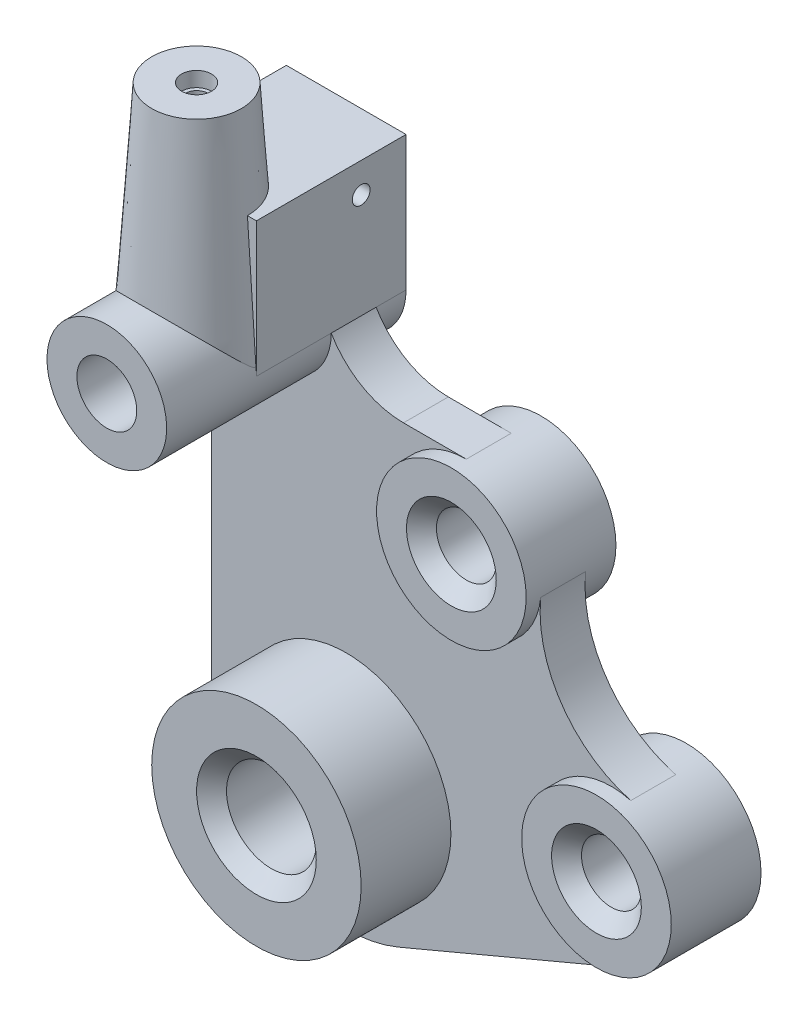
ISO-10303-21;
HEADER;
FILE_DESCRIPTION(('STEP AP214'),'2;1');
FILE_NAME('part.step','',(''),(''),'','','');
FILE_SCHEMA(('AUTOMOTIVE_DESIGN { 1 0 10303 214 1 1 1 1 }'));
ENDSEC;
DATA;
#1=APPLICATION_CONTEXT('core data for automotive mechanical design processes');
#2=APPLICATION_PROTOCOL_DEFINITION('international standard','automotive_design',2000,#1);
#3=PRODUCT_CONTEXT('',#1,'mechanical');
#4=PRODUCT('Part','Part','',(#3));
#5=PRODUCT_RELATED_PRODUCT_CATEGORY('part','',(#4));
#6=PRODUCT_DEFINITION_FORMATION('','',#4);
#7=PRODUCT_DEFINITION_CONTEXT('part definition',#1,'design');
#8=PRODUCT_DEFINITION('design','',#6,#7);
#9=PRODUCT_DEFINITION_SHAPE('','',#8);
#10=(LENGTH_UNIT() NAMED_UNIT(*) SI_UNIT(.MILLI.,.METRE.));
#11=(NAMED_UNIT(*) PLANE_ANGLE_UNIT() SI_UNIT($,.RADIAN.));
#12=(NAMED_UNIT(*) SI_UNIT($,.STERADIAN.) SOLID_ANGLE_UNIT());
#13=UNCERTAINTY_MEASURE_WITH_UNIT(LENGTH_MEASURE(1.E-05),#10,'distance_accuracy_value','');
#14=(GEOMETRIC_REPRESENTATION_CONTEXT(3) GLOBAL_UNCERTAINTY_ASSIGNED_CONTEXT((#13)) GLOBAL_UNIT_ASSIGNED_CONTEXT((#10,
#11,#12)) REPRESENTATION_CONTEXT('',''));
#15=CARTESIAN_POINT('',(0.,0.,0.));
#16=DIRECTION('',(0.,0.,1.));
#17=DIRECTION('',(1.,0.,0.));
#18=AXIS2_PLACEMENT_3D('',#15,#16,#17);
#19=CARTESIAN_POINT('',(-5.,25.,16.));
#20=DIRECTION('',(0.,0.,-1.));
#21=DIRECTION('',(-1.,0.,0.));
#22=AXIS2_PLACEMENT_3D('',#19,#20,#21);
#23=CYLINDRICAL_SURFACE('',#22,1.);
#24=CARTESIAN_POINT('',(-5.,25.,0.));
#25=DIRECTION('',(0.,0.,-1.));
#26=DIRECTION('',(-1.,0.,0.));
#27=AXIS2_PLACEMENT_3D('',#24,#25,#26);
#28=CIRCLE('',#27,1.);
#29=CARTESIAN_POINT('',(-6.,25.,0.));
#30=VERTEX_POINT('',#29);
#31=EDGE_CURVE('E212',#30,#30,#28,.T.);
#32=ORIENTED_EDGE('',*,*,#31,.T.);
#33=EDGE_LOOP('',(#32));
#34=FACE_BOUND('',#33,.T.);
#35=CARTESIAN_POINT('',(-5.,25.,9.));
#36=DIRECTION('',(0.,0.,1.));
#37=DIRECTION('',(1.,0.,0.));
#38=AXIS2_PLACEMENT_3D('',#35,#36,#37);
#39=CIRCLE('',#38,1.);
#40=CARTESIAN_POINT('',(-4.,25.,9.));
#41=VERTEX_POINT('',#40);
#42=EDGE_CURVE('E174',#41,#41,#39,.F.);
#43=ORIENTED_EDGE('',*,*,#42,.F.);
#44=EDGE_LOOP('',(#43));
#45=FACE_BOUND('',#44,.T.);
#46=ADVANCED_FACE('F33',(#34,#45),#23,.F.);
#47=CARTESIAN_POINT('',(-5.,25.,16.));
#48=DIRECTION('',(0.,0.,-1.));
#49=DIRECTION('',(-1.,0.,0.));
#50=AXIS2_PLACEMENT_3D('',#47,#48,#49);
#51=CYLINDRICAL_SURFACE('',#50,4.);
#52=DIRECTION('',(0.,0.,-1.));
#53=VECTOR('',#52,1.);
#54=CARTESIAN_POINT('',(-9.,25.,10.));
#55=LINE('',#54,#53);
#56=CARTESIAN_POINT('',(-9.,25.,2.));
#57=VERTEX_POINT('',#56);
#58=CARTESIAN_POINT('',(-9.,25.,0.));
#59=VERTEX_POINT('',#58);
#60=EDGE_CURVE('E204',#57,#59,#55,.T.);
#61=ORIENTED_EDGE('',*,*,#60,.T.);
#62=CARTESIAN_POINT('',(-5.,25.,0.));
#63=DIRECTION('',(0.,0.,-1.));
#64=DIRECTION('',(-1.,0.,0.));
#65=AXIS2_PLACEMENT_3D('',#62,#63,#64);
#66=CIRCLE('',#65,4.);
#67=CARTESIAN_POINT('',(-0.999999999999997,25.,0.));
#68=VERTEX_POINT('',#67);
#69=EDGE_CURVE('E258',#68,#59,#66,.T.);
#70=ORIENTED_EDGE('',*,*,#69,.F.);
#71=DIRECTION('',(0.,0.,-1.));
#72=VECTOR('',#71,1.);
#73=CARTESIAN_POINT('',(-0.999999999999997,25.,10.));
#74=LINE('',#73,#72);
#75=CARTESIAN_POINT('',(-0.999999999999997,25.,2.));
#76=VERTEX_POINT('',#75);
#77=EDGE_CURVE('E189',#76,#68,#74,.T.);
#78=ORIENTED_EDGE('',*,*,#77,.F.);
#79=CARTESIAN_POINT('',(-5.,25.,2.));
#80=DIRECTION('',(0.,0.,1.));
#81=DIRECTION('',(1.,0.,0.));
#82=AXIS2_PLACEMENT_3D('',#79,#80,#81);
#83=CIRCLE('',#82,4.);
#84=EDGE_CURVE('E267',#57,#76,#83,.T.);
#85=ORIENTED_EDGE('',*,*,#84,.F.);
#86=EDGE_LOOP('',(#61,#70,#78,#85));
#87=FACE_BOUND('',#86,.T.);
#88=ADVANCED_FACE('F233',(#87),#51,.T.);
#89=CARTESIAN_POINT('',(-5.,40.,10.));
#90=DIRECTION('',(0.,-1.,0.));
#91=DIRECTION('',(1.,0.,0.));
#92=AXIS2_PLACEMENT_3D('',#89,#90,#91);
#93=CONICAL_SURFACE('',#92,3.,0.0665681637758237);
#94=CARTESIAN_POINT('',(-5.,40.,10.));
#95=DIRECTION('',(0.,1.,0.));
#96=DIRECTION('',(-1.,0.,0.));
#97=AXIS2_PLACEMENT_3D('',#94,#95,#96);
#98=CIRCLE('',#97,3.);
#99=CARTESIAN_POINT('',(-8.,40.,10.));
#100=VERTEX_POINT('',#99);
#101=EDGE_CURVE('E209',#100,#100,#98,.T.);
#102=ORIENTED_EDGE('',*,*,#101,.F.);
#103=EDGE_LOOP('',(#102));
#104=FACE_BOUND('',#103,.T.);
#105=CARTESIAN_POINT('',(-7.68582917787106,27.9641730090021,7.30844289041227));
#106=CARTESIAN_POINT('',(-7.87145436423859,27.7959706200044,7.47783702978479));
#107=CARTESIAN_POINT('',(-8.035246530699,27.6158841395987,7.65934261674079));
#108=CARTESIAN_POINT('',(-8.24998615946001,27.3348453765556,7.94315535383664));
#109=CARTESIAN_POINT('',(-8.31642185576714,27.2393200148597,8.0397132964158));
#110=CARTESIAN_POINT('',(-8.43944384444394,27.0453361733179,8.23609940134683));
#111=CARTESIAN_POINT('',(-8.49603313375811,26.9468785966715,8.33592655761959));
#112=CARTESIAN_POINT('',(-8.59844682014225,26.7501960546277,8.53588493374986));
#113=CARTESIAN_POINT('',(-8.64449597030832,26.6520216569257,8.6359519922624));
#114=CARTESIAN_POINT('',(-8.7277325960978,26.4544628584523,8.83827041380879));
#115=CARTESIAN_POINT('',(-8.76493210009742,26.3550802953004,8.94051860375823));
#116=CARTESIAN_POINT('',(-8.81898682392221,26.1915948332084,9.11062343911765));
#117=CARTESIAN_POINT('',(-8.83836727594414,26.1275439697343,9.17774736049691));
#118=CARTESIAN_POINT('',(-8.87359959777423,25.9997940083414,9.31343849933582));
#119=CARTESIAN_POINT('',(-8.88944767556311,25.9360953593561,9.38200718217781));
#120=CARTESIAN_POINT('',(-8.91408514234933,25.8260334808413,9.50471878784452));
#121=CARTESIAN_POINT('',(-8.92365412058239,25.7792160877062,9.5583224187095));
#122=CARTESIAN_POINT('',(-8.94058969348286,25.6883224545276,9.66845927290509));
#123=CARTESIAN_POINT('',(-8.94795780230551,25.6442443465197,9.72499045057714));
#124=CARTESIAN_POINT('',(-8.95581978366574,25.5930331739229,9.8070876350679));
#125=CARTESIAN_POINT('',(-8.95767477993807,25.5804643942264,9.82898958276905));
#126=CARTESIAN_POINT('',(-8.9608422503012,25.5584333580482,9.87431424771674));
#127=CARTESIAN_POINT('',(-8.96215765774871,25.5489543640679,9.89772791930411));
#128=CARTESIAN_POINT('',(-8.96368162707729,25.5378187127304,9.93742626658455));
#129=CARTESIAN_POINT('',(-8.96411828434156,25.5345738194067,9.95323635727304));
#130=CARTESIAN_POINT('',(-8.96460979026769,25.5309172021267,9.98517616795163));
#131=CARTESIAN_POINT('',(-8.96466542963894,25.5304996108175,10.0013051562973));
#132=CARTESIAN_POINT('',(-8.96438751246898,25.5325711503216,10.0333365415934));
#133=CARTESIAN_POINT('',(-8.96405448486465,25.5350563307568,10.0492392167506));
#134=CARTESIAN_POINT('',(-8.96305127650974,25.5424381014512,10.0804790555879));
#135=CARTESIAN_POINT('',(-8.96238015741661,25.547341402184,10.0958145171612));
#136=CARTESIAN_POINT('',(-8.95951482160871,25.5678471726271,10.1494331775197));
#137=CARTESIAN_POINT('',(-8.95658729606,25.5881313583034,10.1857842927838));
#138=CARTESIAN_POINT('',(-8.94969115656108,25.6328361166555,10.2558278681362));
#139=CARTESIAN_POINT('',(-8.94571249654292,25.6572957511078,10.2894903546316));
#140=CARTESIAN_POINT('',(-8.93146814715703,25.7394824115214,10.396472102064));
#141=CARTESIAN_POINT('',(-8.91954789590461,25.8006702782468,10.4669160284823));
#142=CARTESIAN_POINT('',(-8.89214832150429,25.9248448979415,10.6055042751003));
#143=CARTESIAN_POINT('',(-8.87666231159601,25.9878348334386,10.6736439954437));
#144=CARTESIAN_POINT('',(-8.84222339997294,26.1142602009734,10.8083167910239));
#145=CARTESIAN_POINT('',(-8.82327989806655,26.1776939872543,10.8748536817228));
#146=CARTESIAN_POINT('',(-8.78191536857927,26.3044431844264,11.0068408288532));
#147=CARTESIAN_POINT('',(-8.75949660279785,26.3677586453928,11.0722917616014));
#148=CARTESIAN_POINT('',(-8.6862782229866,26.5588854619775,11.2690386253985));
#149=CARTESIAN_POINT('',(-8.6299834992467,26.6861300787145,11.3988999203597));
#150=CARTESIAN_POINT('',(-8.50233856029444,26.9374016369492,11.6544976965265));
#151=CARTESIAN_POINT('',(-8.43097643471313,27.061425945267,11.7802308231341));
#152=CARTESIAN_POINT('',(-8.27257126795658,27.3046304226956,12.0263481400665));
#153=CARTESIAN_POINT('',(-8.18553529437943,27.4238127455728,12.1467347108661));
#154=CARTESIAN_POINT('',(-7.99510064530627,27.6555316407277,12.3805644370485));
#155=CARTESIAN_POINT('',(-7.89171641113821,27.7680739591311,12.4940135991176));
#156=CARTESIAN_POINT('',(-7.64749644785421,28.0040930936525,12.7317895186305));
#157=CARTESIAN_POINT('',(-7.50326898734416,28.1258713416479,12.8543778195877));
#158=CARTESIAN_POINT('',(-7.1903321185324,28.3525627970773,13.0824827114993));
#159=CARTESIAN_POINT('',(-7.0216674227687,28.45750608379,13.1880297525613));
#160=CARTESIAN_POINT('',(-6.6930449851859,28.6278518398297,13.3593136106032));
#161=CARTESIAN_POINT('',(-6.53702387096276,28.6969727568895,13.4287978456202));
#162=CARTESIAN_POINT('',(-6.2925871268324,28.7863934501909,13.5186772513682));
#163=CARTESIAN_POINT('',(-6.20934434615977,28.8138303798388,13.5462527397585));
#164=CARTESIAN_POINT('',(-6.0398068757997,28.863494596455,13.5961651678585));
#165=CARTESIAN_POINT('',(-5.9535135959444,28.8857242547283,13.6185044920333));
#166=CARTESIAN_POINT('',(-5.77768444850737,28.924714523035,13.6576856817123));
#167=CARTESIAN_POINT('',(-5.68812764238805,28.9414283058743,13.6744804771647));
#168=CARTESIAN_POINT('',(-5.50720161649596,28.968766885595,13.7019509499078));
#169=CARTESIAN_POINT('',(-5.4158333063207,28.9793946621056,13.7126296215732));
#170=CARTESIAN_POINT('',(-5.23208545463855,28.9943247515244,13.7276310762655));
#171=CARTESIAN_POINT('',(-5.13970619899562,28.9986288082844,13.7319556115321));
#172=CARTESIAN_POINT('',(-4.95480169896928,29.0008129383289,13.7341501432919));
#173=CARTESIAN_POINT('',(-4.86227647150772,28.9986937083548,13.7320208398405));
#174=CARTESIAN_POINT('',(-4.68959143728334,28.9887534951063,13.72203320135));
#175=CARTESIAN_POINT('',(-4.60934296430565,28.9816848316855,13.71493078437));
#176=CARTESIAN_POINT('',(-4.44996289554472,28.9628160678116,13.6959714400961));
#177=CARTESIAN_POINT('',(-4.37083166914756,28.9510144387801,13.6841129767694));
#178=CARTESIAN_POINT('',(-4.1359618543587,28.9087935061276,13.6416872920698));
#179=CARTESIAN_POINT('',(-3.98259980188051,28.87154918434,13.604260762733));
#180=CARTESIAN_POINT('',(-3.68165060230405,28.7798752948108,13.5121269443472));
#181=CARTESIAN_POINT('',(-3.53434669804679,28.7249923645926,13.4569637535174));
#182=CARTESIAN_POINT('',(-3.25217140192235,28.6012299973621,13.3325462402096));
#183=CARTESIAN_POINT('',(-3.11730521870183,28.5323447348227,13.2632860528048));
#184=CARTESIAN_POINT('',(-2.79321185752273,28.3438647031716,13.0737311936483));
#185=CARTESIAN_POINT('',(-2.61285212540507,28.2166923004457,12.9457918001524));
#186=CARTESIAN_POINT('',(-2.28313085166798,27.9435845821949,12.6708541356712));
#187=CARTESIAN_POINT('',(-2.13386439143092,27.7975938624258,12.5237995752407));
#188=CARTESIAN_POINT('',(-1.90655552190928,27.5397572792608,12.2637659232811));
#189=CARTESIAN_POINT('',(-1.82071746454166,27.4311936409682,12.154190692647));
#190=CARTESIAN_POINT('',(-1.66272245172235,27.2093283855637,11.9299570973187));
#191=CARTESIAN_POINT('',(-1.59057233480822,27.0960244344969,11.8152962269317));
#192=CARTESIAN_POINT('',(-1.45956259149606,26.8662193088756,11.5821671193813));
#193=CARTESIAN_POINT('',(-1.40068096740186,26.749723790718,11.4637055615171));
#194=CARTESIAN_POINT('',(-1.29559154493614,26.5145624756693,11.2234895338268));
#195=CARTESIAN_POINT('',(-1.24937700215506,26.3958978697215,11.1017368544));
#196=CARTESIAN_POINT('',(-1.18723891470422,26.211468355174,10.9101391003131));
#197=CARTESIAN_POINT('',(-1.16702584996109,26.1458467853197,10.8415034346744));
#198=CARTESIAN_POINT('',(-1.13030223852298,26.0149043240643,10.7027746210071));
#199=CARTESIAN_POINT('',(-1.11379531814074,25.9495837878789,10.6326801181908));
#200=CARTESIAN_POINT('',(-1.08791721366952,25.8356092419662,10.506158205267));
#201=CARTESIAN_POINT('',(-1.07777676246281,25.7865363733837,10.4502382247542));
#202=CARTESIAN_POINT('',(-1.05990149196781,25.69126516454,10.3354340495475));
#203=CARTESIAN_POINT('',(-1.0521606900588,25.6450599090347,10.2765576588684));
#204=CARTESIAN_POINT('',(-1.04427829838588,25.5936572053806,10.1938421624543));
#205=CARTESIAN_POINT('',(-1.04259787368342,25.5823041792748,10.1741443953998));
#206=CARTESIAN_POINT('',(-1.0396638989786,25.561995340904,10.1335158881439));
#207=CARTESIAN_POINT('',(-1.03840918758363,25.5530330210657,10.1125886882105));
#208=CARTESIAN_POINT('',(-1.03676737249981,25.5411225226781,10.0756549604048));
#209=CARTESIAN_POINT('',(-1.03623406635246,25.5371832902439,10.0599875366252));
#210=CARTESIAN_POINT('',(-1.03553602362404,25.5320082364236,10.0282184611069));
#211=CARTESIAN_POINT('',(-1.0353703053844,25.530765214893,10.0121180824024));
#212=CARTESIAN_POINT('',(-1.03543409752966,25.5312409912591,9.97992802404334));
#213=CARTESIAN_POINT('',(-1.03566451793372,25.5329666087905,9.96383845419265));
#214=CARTESIAN_POINT('',(-1.0364838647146,25.5390262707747,9.93215634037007));
#215=CARTESIAN_POINT('',(-1.03707369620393,25.5433669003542,9.91656515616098));
#216=CARTESIAN_POINT('',(-1.03944186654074,25.5604572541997,9.86718928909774));
#217=CARTESIAN_POINT('',(-1.04178723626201,25.5769618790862,9.83480223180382));
#218=CARTESIAN_POINT('',(-1.04735472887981,25.6139728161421,9.77238923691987));
#219=CARTESIAN_POINT('',(-1.05058515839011,25.6345164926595,9.74238933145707));
#220=CARTESIAN_POINT('',(-1.06195631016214,25.7028787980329,9.64879780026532));
#221=CARTESIAN_POINT('',(-1.07135894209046,25.7540103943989,9.58780636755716));
#222=CARTESIAN_POINT('',(-1.09280352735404,25.8583327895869,9.46806904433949));
#223=CARTESIAN_POINT('',(-1.10485114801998,25.9115278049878,9.40932829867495));
#224=CARTESIAN_POINT('',(-1.13148029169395,26.01861482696,9.29329387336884));
#225=CARTESIAN_POINT('',(-1.1460557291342,26.0725048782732,9.23599708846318));
#226=CARTESIAN_POINT('',(-1.17772230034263,26.1804079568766,9.1223368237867));
#227=CARTESIAN_POINT('',(-1.19481127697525,26.2344208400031,9.06597258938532));
#228=CARTESIAN_POINT('',(-1.25009262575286,26.396896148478,8.89733666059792));
#229=CARTESIAN_POINT('',(-1.2921543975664,26.5052028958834,8.78614984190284));
#230=CARTESIAN_POINT('',(-1.38681808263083,26.7200964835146,8.56649859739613));
#231=CARTESIAN_POINT('',(-1.43942654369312,26.8266822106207,8.45803591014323));
#232=CARTESIAN_POINT('',(-1.55555963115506,27.0372253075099,8.24429301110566));
#233=CARTESIAN_POINT('',(-1.61908938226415,27.1411814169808,8.13901432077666));
#234=CARTESIAN_POINT('',(-1.75742667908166,27.3454053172,7.93247040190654));
#235=CARTESIAN_POINT('',(-1.83222989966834,27.4456745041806,7.83120365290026));
#236=CARTESIAN_POINT('',(-2.03864267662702,27.6961951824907,7.57840275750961));
#237=CARTESIAN_POINT('',(-2.17867516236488,27.8431538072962,7.43031250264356));
#238=CARTESIAN_POINT('',(-2.48883703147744,28.1204503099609,7.15106579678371));
#239=CARTESIAN_POINT('',(-2.65892205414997,28.2508122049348,7.01988487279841));
#240=CARTESIAN_POINT('',(-2.98939297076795,28.4622439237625,6.80720462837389));
#241=CARTESIAN_POINT('',(-3.14386712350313,28.54787068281,6.72110240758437));
#242=CARTESIAN_POINT('',(-3.47048863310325,28.7003989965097,6.56775571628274));
#243=CARTESIAN_POINT('',(-3.64261412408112,28.7673233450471,6.50048829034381));
#244=CARTESIAN_POINT('',(-3.97391965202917,28.8694240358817,6.39787480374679));
#245=CARTESIAN_POINT('',(-4.13105028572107,28.9078914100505,6.3592192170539));
#246=CARTESIAN_POINT('',(-4.4522654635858,28.9656723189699,6.30115802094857));
#247=CARTESIAN_POINT('',(-4.61634604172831,28.9849966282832,6.28174158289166));
#248=CARTESIAN_POINT('',(-4.94721383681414,29.0030895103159,6.26356239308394));
#249=CARTESIAN_POINT('',(-5.11400679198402,29.0018066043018,6.26485136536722));
#250=CARTESIAN_POINT('',(-5.4446841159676,28.9786610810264,6.28810742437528));
#251=CARTESIAN_POINT('',(-5.60856797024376,28.956794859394,6.31007813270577));
#252=CARTESIAN_POINT('',(-5.9232086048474,28.8951915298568,6.37198127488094));
#253=CARTESIAN_POINT('',(-6.07422345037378,28.8560996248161,6.41126523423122));
#254=CARTESIAN_POINT('',(-6.36627844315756,28.762558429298,6.50527833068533));
#255=CARTESIAN_POINT('',(-6.50731450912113,28.7081029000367,6.56001374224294));
#256=CARTESIAN_POINT('',(-6.84318506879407,28.5568315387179,6.71208985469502));
#257=CARTESIAN_POINT('',(-7.03102173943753,28.4522695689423,6.81722970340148));
#258=CARTESIAN_POINT('',(-7.37910283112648,28.2223691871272,7.04850657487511));
#259=CARTESIAN_POINT('',(-7.53927103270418,28.0969751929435,7.17469977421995));
#260=CARTESIAN_POINT('',(-7.68582917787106,27.9641730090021,7.30844289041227));
#261=B_SPLINE_CURVE_WITH_KNOTS('',3,(#105,#106,#107,#108,#109,#110,#111,#112,#113,#114,#115,
#116,#117,#118,#119,#120,#121,#122,#123,#124,#125,#126,#127,#128,#129,#130,#131,#132,#133,#134,
#135,#136,#137,#138,#139,#140,#141,#142,#143,#144,#145,#146,#147,#148,#149,#150,#151,#152,#153,
#154,#155,#156,#157,#158,#159,#160,#161,#162,#163,#164,#165,#166,#167,#168,#169,#170,#171,#172,
#173,#174,#175,#176,#177,#178,#179,#180,#181,#182,#183,#184,#185,#186,#187,#188,#189,#190,#191,
#192,#193,#194,#195,#196,#197,#198,#199,#200,#201,#202,#203,#204,#205,#206,#207,#208,#209,#210,
#211,#212,#213,#214,#215,#216,#217,#218,#219,#220,#221,#222,#223,#224,#225,#226,#227,#228,#229,
#230,#231,#232,#233,#234,#235,#236,#237,#238,#239,#240,#241,#242,#243,#244,#245,#246,#247,#248,
#249,#250,#251,#252,#253,#254,#255,#256,#257,#258,#259,#260),.UNSPECIFIED.,.T.,.F.,(4,2,2,2,2,2,
2,2,2,2,2,2,2,2,2,2,2,2,2,2,2,2,2,2,2,2,2,2,2,2,2,2,2,2,2,2,2,2,2,2,2,2,2,2,2,2,2,2,2,2,2,2,2,2,
2,2,2,2,2,2,2,2,2,2,2,2,2,2,2,2,2,2,2,2,2,2,2,4),(0.,0.906183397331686,1.35952296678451,
1.81272431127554,2.2551055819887,2.696882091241,2.98118412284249,3.26578989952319,
3.48129917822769,3.69665984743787,3.77250844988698,3.84793907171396,3.89616349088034,
3.94428780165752,3.99234669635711,4.04053971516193,4.16469985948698,4.29009250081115,
4.57179840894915,4.85403695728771,5.13551932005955,5.41681924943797,5.98711445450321,
6.55786216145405,7.12835315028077,7.69834297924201,8.3713231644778,9.04308720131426,
9.5934293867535,9.86878537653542,10.1440157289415,10.4215259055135,10.6989001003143,
10.9761977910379,11.2534654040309,11.4957860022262,11.7381849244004,12.2225446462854,
12.7205105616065,13.218684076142,13.9797319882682,14.74307404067,15.2719983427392,
15.8011862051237,16.3294901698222,16.8575122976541,17.1487243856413,17.440220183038,
17.6655792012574,17.8903717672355,17.9586769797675,18.0267943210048,18.0750999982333,
18.1232765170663,18.1715638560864,18.2199733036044,18.3283739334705,18.4378290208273,
18.6777999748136,18.9182902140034,19.1582093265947,19.3979237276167,19.8799739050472,
20.3623242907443,20.844901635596,21.327294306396,22.078571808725,22.8287494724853,
23.416052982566,24.0026375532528,24.4994632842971,24.9960092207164,25.4937957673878,
25.9916694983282,26.4722990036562,26.9531239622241,27.6666549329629,28.3821211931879),.UNSPECIFIED.);
#262=CARTESIAN_POINT('',(-8.96460176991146,25.5309734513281,9.99999999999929));
#263=VERTEX_POINT('',#262);
#264=CARTESIAN_POINT('',(-1.0353982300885,25.5309734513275,10.));
#265=VERTEX_POINT('',#264);
#266=EDGE_CURVE('E213',#263,#265,#261,.T.);
#267=ORIENTED_EDGE('',*,*,#266,.T.);
#268=DIRECTION('',(0.0665190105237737,-0.997785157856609,0.));
#269=VECTOR('',#268,1.);
#270=CARTESIAN_POINT('',(-4.99999999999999,85.0000000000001,10.));
#271=LINE('',#270,#269);
#272=CARTESIAN_POINT('',(-1.6,34.,10.));
#273=VERTEX_POINT('',#272);
#274=EDGE_CURVE('E375',#265,#273,#271,.F.);
#275=ORIENTED_EDGE('',*,*,#274,.T.);
#276=CARTESIAN_POINT('',(-5.,34.,10.));
#277=DIRECTION('',(0.,1.,0.));
#278=DIRECTION('',(0.,0.,1.));
#279=AXIS2_PLACEMENT_3D('',#276,#277,#278);
#280=CIRCLE('',#279,3.4);
#281=CARTESIAN_POINT('',(-8.4,34.,10.));
#282=VERTEX_POINT('',#281);
#283=EDGE_CURVE('E373',#282,#273,#280,.F.);
#284=ORIENTED_EDGE('',*,*,#283,.F.);
#285=DIRECTION('',(0.0665190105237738,0.997785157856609,0.));
#286=VECTOR('',#285,1.);
#287=CARTESIAN_POINT('',(-4.99999999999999,85.0000000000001,10.));
#288=LINE('',#287,#286);
#289=EDGE_CURVE('E220',#282,#263,#288,.F.);
#290=ORIENTED_EDGE('',*,*,#289,.T.);
#291=EDGE_LOOP('',(#267,#275,#284,#290));
#292=FACE_BOUND('',#291,.T.);
#293=ADVANCED_FACE('F227',(#104,#292),#93,.T.);
#294=CARTESIAN_POINT('',(0.,0.,5.));
#295=DIRECTION('',(0.,0.,1.));
#296=DIRECTION('',(1.,0.,0.));
#297=AXIS2_PLACEMENT_3D('',#294,#295,#296);
#298=PLANE('',#297);
#299=CARTESIAN_POINT('',(-5.,25.,5.));
#300=DIRECTION('',(0.,0.,1.));
#301=DIRECTION('',(1.,0.,0.));
#302=AXIS2_PLACEMENT_3D('',#299,#300,#301);
#303=CIRCLE('',#302,4.);
#304=CARTESIAN_POINT('',(-9.,25.,5.));
#305=VERTEX_POINT('',#304);
#306=CARTESIAN_POINT('',(-0.999999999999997,25.,5.));
#307=VERTEX_POINT('',#306);
#308=EDGE_CURVE('E271',#305,#307,#303,.T.);
#309=ORIENTED_EDGE('',*,*,#308,.F.);
#310=DIRECTION('',(0.,1.,0.));
#311=VECTOR('',#310,1.);
#312=CARTESIAN_POINT('',(-9.,0.,5.));
#313=LINE('',#312,#311);
#314=CARTESIAN_POINT('',(-9.,0.,5.));
#315=VERTEX_POINT('',#314);
#316=EDGE_CURVE('E300',#315,#305,#313,.T.);
#317=ORIENTED_EDGE('',*,*,#316,.F.);
#318=CARTESIAN_POINT('',(0.,0.,5.));
#319=DIRECTION('',(0.,0.,-1.));
#320=DIRECTION('',(1.,0.,0.));
#321=AXIS2_PLACEMENT_3D('',#318,#319,#320);
#322=CIRCLE('',#321,9.);
#323=CARTESIAN_POINT('',(3.49337208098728,-8.29435660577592,5.));
#324=VERTEX_POINT('',#323);
#325=EDGE_CURVE('E297',#324,#315,#322,.T.);
#326=ORIENTED_EDGE('',*,*,#325,.F.);
#327=DIRECTION('',(-0.921595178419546,-0.388152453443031,0.));
#328=VECTOR('',#327,1.);
#329=CARTESIAN_POINT('',(19.6673018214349,-1.48230869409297,5.));
#330=LINE('',#329,#328);
#331=CARTESIAN_POINT('',(19.6673018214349,-1.48230869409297,5.));
#332=VERTEX_POINT('',#331);
#333=EDGE_CURVE('E316',#332,#324,#330,.T.);
#334=ORIENTED_EDGE('',*,*,#333,.F.);
#335=CARTESIAN_POINT('',(17.7265395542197,3.12566719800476,5.));
#336=DIRECTION('',(0.,0.,1.));
#337=DIRECTION('',(-1.,0.,0.));
#338=AXIS2_PLACEMENT_3D('',#335,#336,#337);
#339=CIRCLE('',#338,5.);
#340=CARTESIAN_POINT('',(19.0232094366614,7.95460571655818,5.));
#341=VERTEX_POINT('',#340);
#342=EDGE_CURVE('E56',#341,#332,#339,.T.);
#343=ORIENTED_EDGE('',*,*,#342,.F.);
#344=CARTESIAN_POINT('',(21.1463076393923,15.8612524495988,5.));
#345=DIRECTION('',(0.,0.,1.));
#346=DIRECTION('',(1.,0.,0.));
#347=AXIS2_PLACEMENT_3D('',#344,#345,#346);
#348=CIRCLE('',#347,8.18673369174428);
#349=CARTESIAN_POINT('',(13.0031395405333,16.7047107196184,5.));
#350=VERTEX_POINT('',#349);
#351=EDGE_CURVE('E312',#350,#341,#348,.T.);
#352=ORIENTED_EDGE('',*,*,#351,.F.);
#353=CARTESIAN_POINT('',(8.02974697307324,17.2198479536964,5.));
#354=DIRECTION('',(0.,0.,1.));
#355=DIRECTION('',(-1.,0.,0.));
#356=AXIS2_PLACEMENT_3D('',#353,#354,#355);
#357=CIRCLE('',#356,5.);
#358=CARTESIAN_POINT('',(8.02974697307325,22.2198479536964,5.));
#359=VERTEX_POINT('',#358);
#360=EDGE_CURVE('E310',#359,#350,#357,.T.);
#361=ORIENTED_EDGE('',*,*,#360,.F.);
#362=DIRECTION('',(1.,0.,0.));
#363=VECTOR('',#362,1.);
#364=CARTESIAN_POINT('',(8.02974697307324,22.2198479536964,5.));
#365=LINE('',#364,#363);
#366=CARTESIAN_POINT('',(3.82779824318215,22.2198479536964,5.));
#367=VERTEX_POINT('',#366);
#368=EDGE_CURVE('E307',#367,#359,#365,.T.);
#369=ORIENTED_EDGE('',*,*,#368,.F.);
#370=CARTESIAN_POINT('',(3.82779824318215,27.8017155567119,5.));
#371=DIRECTION('',(0.,0.,1.));
#372=DIRECTION('',(1.,0.,0.));
#373=AXIS2_PLACEMENT_3D('',#370,#371,#372);
#374=CIRCLE('',#373,5.58186760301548);
#375=EDGE_CURVE('E304',#307,#367,#374,.T.);
#376=ORIENTED_EDGE('',*,*,#375,.F.);
#377=EDGE_LOOP('',(#309,#317,#326,#334,#343,#352,#361,#369,#376));
#378=FACE_BOUND('',#377,.T.);
#379=CARTESIAN_POINT('',(0.,0.,5.));
#380=DIRECTION('',(0.,0.,1.));
#381=DIRECTION('',(1.,0.,0.));
#382=AXIS2_PLACEMENT_3D('',#379,#380,#381);
#383=CIRCLE('',#382,7.);
#384=CARTESIAN_POINT('',(7.,0.,5.));
#385=VERTEX_POINT('',#384);
#386=EDGE_CURVE('E284',#385,#385,#383,.F.);
#387=ORIENTED_EDGE('',*,*,#386,.T.);
#388=EDGE_LOOP('',(#387));
#389=FACE_BOUND('',#388,.T.);
#390=ADVANCED_FACE('F232',(#378,#389),#298,.T.);
#391=CARTESIAN_POINT('',(0.,0.,2.));
#392=DIRECTION('',(0.,0.,1.));
#393=DIRECTION('',(1.,0.,0.));
#394=AXIS2_PLACEMENT_3D('',#391,#392,#393);
#395=PLANE('',#394);
#396=DIRECTION('',(0.,1.,0.));
#397=VECTOR('',#396,1.);
#398=CARTESIAN_POINT('',(-9.,0.,2.));
#399=LINE('',#398,#397);
#400=CARTESIAN_POINT('',(-9.,0.,2.));
#401=VERTEX_POINT('',#400);
#402=EDGE_CURVE('E322',#401,#57,#399,.T.);
#403=ORIENTED_EDGE('',*,*,#402,.T.);
#404=ORIENTED_EDGE('',*,*,#84,.T.);
#405=CARTESIAN_POINT('',(3.82779824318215,27.8017155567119,2.));
#406=DIRECTION('',(0.,0.,1.));
#407=DIRECTION('',(1.,0.,0.));
#408=AXIS2_PLACEMENT_3D('',#405,#406,#407);
#409=CIRCLE('',#408,5.58186760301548);
#410=CARTESIAN_POINT('',(3.82779824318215,22.2198479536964,2.));
#411=VERTEX_POINT('',#410);
#412=EDGE_CURVE('E325',#76,#411,#409,.T.);
#413=ORIENTED_EDGE('',*,*,#412,.T.);
#414=DIRECTION('',(1.,0.,0.));
#415=VECTOR('',#414,1.);
#416=CARTESIAN_POINT('',(8.02974697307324,22.2198479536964,2.));
#417=LINE('',#416,#415);
#418=CARTESIAN_POINT('',(8.02974697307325,22.2198479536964,2.));
#419=VERTEX_POINT('',#418);
#420=EDGE_CURVE('E328',#411,#419,#417,.T.);
#421=ORIENTED_EDGE('',*,*,#420,.T.);
#422=CARTESIAN_POINT('',(8.02974697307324,17.2198479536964,2.));
#423=DIRECTION('',(0.,0.,1.));
#424=DIRECTION('',(-1.,0.,0.));
#425=AXIS2_PLACEMENT_3D('',#422,#423,#424);
#426=CIRCLE('',#425,5.);
#427=CARTESIAN_POINT('',(13.0031395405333,16.7047107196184,2.));
#428=VERTEX_POINT('',#427);
#429=EDGE_CURVE('E331',#419,#428,#426,.T.);
#430=ORIENTED_EDGE('',*,*,#429,.T.);
#431=CARTESIAN_POINT('',(21.1463076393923,15.8612524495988,2.));
#432=DIRECTION('',(0.,0.,1.));
#433=DIRECTION('',(1.,0.,0.));
#434=AXIS2_PLACEMENT_3D('',#431,#432,#433);
#435=CIRCLE('',#434,8.18673369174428);
#436=CARTESIAN_POINT('',(19.0232094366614,7.95460571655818,2.));
#437=VERTEX_POINT('',#436);
#438=EDGE_CURVE('E334',#428,#437,#435,.T.);
#439=ORIENTED_EDGE('',*,*,#438,.T.);
#440=CARTESIAN_POINT('',(17.7265395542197,3.12566719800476,2.));
#441=DIRECTION('',(0.,0.,1.));
#442=DIRECTION('',(-1.,0.,0.));
#443=AXIS2_PLACEMENT_3D('',#440,#441,#442);
#444=CIRCLE('',#443,5.);
#445=CARTESIAN_POINT('',(19.6673018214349,-1.48230869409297,2.));
#446=VERTEX_POINT('',#445);
#447=EDGE_CURVE('E337',#437,#446,#444,.T.);
#448=ORIENTED_EDGE('',*,*,#447,.T.);
#449=DIRECTION('',(-0.921595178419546,-0.388152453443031,0.));
#450=VECTOR('',#449,1.);
#451=CARTESIAN_POINT('',(19.6673018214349,-1.48230869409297,2.));
#452=LINE('',#451,#450);
#453=CARTESIAN_POINT('',(3.49337208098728,-8.29435660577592,2.));
#454=VERTEX_POINT('',#453);
#455=EDGE_CURVE('E301',#446,#454,#452,.T.);
#456=ORIENTED_EDGE('',*,*,#455,.T.);
#457=CARTESIAN_POINT('',(0.,0.,2.));
#458=DIRECTION('',(0.,0.,-1.));
#459=DIRECTION('',(1.,0.,0.));
#460=AXIS2_PLACEMENT_3D('',#457,#458,#459);
#461=CIRCLE('',#460,9.);
#462=EDGE_CURVE('E294',#454,#401,#461,.T.);
#463=ORIENTED_EDGE('',*,*,#462,.T.);
#464=EDGE_LOOP('',(#403,#404,#413,#421,#430,#439,#448,#456,#463));
#465=FACE_BOUND('',#464,.T.);
#466=CARTESIAN_POINT('',(0.,0.,2.));
#467=DIRECTION('',(0.,0.,1.));
#468=DIRECTION('',(1.,0.,0.));
#469=AXIS2_PLACEMENT_3D('',#466,#467,#468);
#470=CIRCLE('',#469,7.);
#471=CARTESIAN_POINT('',(7.,0.,2.));
#472=VERTEX_POINT('',#471);
#473=EDGE_CURVE('E283',#472,#472,#470,.F.);
#474=ORIENTED_EDGE('',*,*,#473,.F.);
#475=EDGE_LOOP('',(#474));
#476=FACE_BOUND('',#475,.T.);
#477=ADVANCED_FACE('F449',(#465,#476),#395,.F.);
#478=CARTESIAN_POINT('',(17.7265395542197,3.12566719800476,6.));
#479=DIRECTION('',(0.,0.,1.));
#480=DIRECTION('',(1.,0.,0.));
#481=AXIS2_PLACEMENT_3D('',#478,#479,#480);
#482=PLANE('',#481);
#483=CARTESIAN_POINT('',(17.7265395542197,3.12566719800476,6.));
#484=DIRECTION('',(0.,0.,1.));
#485=DIRECTION('',(1.,0.,0.));
#486=AXIS2_PLACEMENT_3D('',#483,#484,#485);
#487=CIRCLE('',#486,3.00000000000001);
#488=CARTESIAN_POINT('',(20.7265395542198,3.12566719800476,6.));
#489=VERTEX_POINT('',#488);
#490=EDGE_CURVE('E397',#489,#489,#487,.F.);
#491=ORIENTED_EDGE('',*,*,#490,.T.);
#492=EDGE_LOOP('',(#491));
#493=FACE_BOUND('',#492,.T.);
#494=CARTESIAN_POINT('',(17.7265395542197,3.12566719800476,6.));
#495=DIRECTION('',(0.,0.,1.));
#496=DIRECTION('',(1.,0.,0.));
#497=AXIS2_PLACEMENT_3D('',#494,#495,#496);
#498=CIRCLE('',#497,5.);
#499=CARTESIAN_POINT('',(22.7265395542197,3.12566719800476,6.));
#500=VERTEX_POINT('',#499);
#501=EDGE_CURVE('E363',#500,#500,#498,.T.);
#502=ORIENTED_EDGE('',*,*,#501,.T.);
#503=EDGE_LOOP('',(#502));
#504=FACE_BOUND('',#503,.T.);
#505=ADVANCED_FACE('F451',(#493,#504),#482,.T.);
#506=CARTESIAN_POINT('',(17.7265395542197,3.12566719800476,0.));
#507=DIRECTION('',(0.,0.,1.));
#508=DIRECTION('',(1.,0.,0.));
#509=AXIS2_PLACEMENT_3D('',#506,#507,#508);
#510=PLANE('',#509);
#511=CARTESIAN_POINT('',(17.7265395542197,3.12566719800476,0.));
#512=DIRECTION('',(0.,0.,1.));
#513=DIRECTION('',(1.,0.,0.));
#514=AXIS2_PLACEMENT_3D('',#511,#512,#513);
#515=CIRCLE('',#514,5.);
#516=CARTESIAN_POINT('',(22.7265395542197,3.12566719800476,0.));
#517=VERTEX_POINT('',#516);
#518=EDGE_CURVE('E362',#517,#517,#515,.T.);
#519=ORIENTED_EDGE('',*,*,#518,.F.);
#520=EDGE_LOOP('',(#519));
#521=FACE_BOUND('',#520,.T.);
#522=CARTESIAN_POINT('',(17.7265395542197,3.12566719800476,0.));
#523=DIRECTION('',(0.,0.,1.));
#524=DIRECTION('',(1.,0.,0.));
#525=AXIS2_PLACEMENT_3D('',#522,#523,#524);
#526=CIRCLE('',#525,2.);
#527=CARTESIAN_POINT('',(19.7265395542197,3.12566719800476,0.));
#528=VERTEX_POINT('',#527);
#529=EDGE_CURVE('E344',#528,#528,#526,.T.);
#530=ORIENTED_EDGE('',*,*,#529,.T.);
#531=EDGE_LOOP('',(#530));
#532=FACE_BOUND('',#531,.T.);
#533=ADVANCED_FACE('F459',(#521,#532),#510,.F.);
#534=CARTESIAN_POINT('',(17.7265395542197,3.12566719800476,6.));
#535=DIRECTION('',(0.,0.,-1.));
#536=DIRECTION('',(-1.,0.,0.));
#537=AXIS2_PLACEMENT_3D('',#534,#535,#536);
#538=CYLINDRICAL_SURFACE('',#537,5.);
#539=DIRECTION('',(0.,0.,-1.));
#540=VECTOR('',#539,1.);
#541=CARTESIAN_POINT('',(19.0232094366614,7.95460571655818,5.));
#542=LINE('',#541,#540);
#543=EDGE_CURVE('E347',#341,#437,#542,.T.);
#544=ORIENTED_EDGE('',*,*,#543,.F.);
#545=ORIENTED_EDGE('',*,*,#342,.T.);
#546=DIRECTION('',(0.,0.,-1.));
#547=VECTOR('',#546,1.);
#548=CARTESIAN_POINT('',(19.6673018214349,-1.48230869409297,5.));
#549=LINE('',#548,#547);
#550=EDGE_CURVE('E345',#332,#446,#549,.T.);
#551=ORIENTED_EDGE('',*,*,#550,.T.);
#552=ORIENTED_EDGE('',*,*,#447,.F.);
#553=EDGE_LOOP('',(#544,#545,#551,#552));
#554=FACE_BOUND('',#553,.T.);
#555=ORIENTED_EDGE('',*,*,#501,.F.);
#556=EDGE_LOOP('',(#555));
#557=FACE_BOUND('',#556,.T.);
#558=ORIENTED_EDGE('',*,*,#518,.T.);
#559=EDGE_LOOP('',(#558));
#560=FACE_BOUND('',#559,.T.);
#561=ADVANCED_FACE('F498',(#554,#557,#560),#538,.T.);
#562=CARTESIAN_POINT('',(17.7265395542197,3.12566719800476,6.));
#563=DIRECTION('',(0.,0.,-1.));
#564=DIRECTION('',(-1.,0.,0.));
#565=AXIS2_PLACEMENT_3D('',#562,#563,#564);
#566=CYLINDRICAL_SURFACE('',#565,2.);
#567=CARTESIAN_POINT('',(17.7265395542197,3.12566719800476,5.));
#568=DIRECTION('',(0.,0.,1.));
#569=DIRECTION('',(1.,0.,0.));
#570=AXIS2_PLACEMENT_3D('',#567,#568,#569);
#571=CIRCLE('',#570,2.);
#572=CARTESIAN_POINT('',(19.7265395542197,3.12566719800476,5.));
#573=VERTEX_POINT('',#572);
#574=EDGE_CURVE('E394',#573,#573,#571,.T.);
#575=ORIENTED_EDGE('',*,*,#574,.T.);
#576=EDGE_LOOP('',(#575));
#577=FACE_BOUND('',#576,.T.);
#578=ORIENTED_EDGE('',*,*,#529,.F.);
#579=EDGE_LOOP('',(#578));
#580=FACE_BOUND('',#579,.T.);
#581=ADVANCED_FACE('F501',(#577,#580),#566,.F.);
#582=CARTESIAN_POINT('',(0.,0.,5.));
#583=DIRECTION('',(0.,0.,-1.));
#584=DIRECTION('',(-1.,0.,0.));
#585=AXIS2_PLACEMENT_3D('',#582,#583,#584);
#586=CYLINDRICAL_SURFACE('',#585,9.);
#587=ORIENTED_EDGE('',*,*,#462,.F.);
#588=DIRECTION('',(0.,0.,-1.));
#589=VECTOR('',#588,1.);
#590=CARTESIAN_POINT('',(3.49337208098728,-8.29435660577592,5.));
#591=LINE('',#590,#589);
#592=EDGE_CURVE('E342',#324,#454,#591,.T.);
#593=ORIENTED_EDGE('',*,*,#592,.F.);
#594=ORIENTED_EDGE('',*,*,#325,.T.);
#595=DIRECTION('',(0.,0.,-1.));
#596=VECTOR('',#595,1.);
#597=CARTESIAN_POINT('',(-9.,0.,5.));
#598=LINE('',#597,#596);
#599=EDGE_CURVE('E319',#315,#401,#598,.T.);
#600=ORIENTED_EDGE('',*,*,#599,.T.);
#601=EDGE_LOOP('',(#587,#593,#594,#600));
#602=FACE_BOUND('',#601,.T.);
#603=ADVANCED_FACE('F507',(#602),#586,.T.);
#604=CARTESIAN_POINT('',(19.6673018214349,-1.48230869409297,5.));
#605=DIRECTION('',(0.388152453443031,-0.921595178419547,0.));
#606=DIRECTION('',(0.921595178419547,0.388152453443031,0.));
#607=AXIS2_PLACEMENT_3D('',#604,#605,#606);
#608=PLANE('',#607);
#609=ORIENTED_EDGE('',*,*,#455,.F.);
#610=ORIENTED_EDGE('',*,*,#550,.F.);
#611=ORIENTED_EDGE('',*,*,#333,.T.);
#612=ORIENTED_EDGE('',*,*,#592,.T.);
#613=EDGE_LOOP('',(#609,#610,#611,#612));
#614=FACE_BOUND('',#613,.T.);
#615=ADVANCED_FACE('F511',(#614),#608,.T.);
#616=CARTESIAN_POINT('',(21.1463076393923,15.8612524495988,5.));
#617=DIRECTION('',(0.,0.,-1.));
#618=DIRECTION('',(-1.,0.,0.));
#619=AXIS2_PLACEMENT_3D('',#616,#617,#618);
#620=CYLINDRICAL_SURFACE('',#619,8.18673369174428);
#621=ORIENTED_EDGE('',*,*,#438,.F.);
#622=DIRECTION('',(0.,0.,-1.));
#623=VECTOR('',#622,1.);
#624=CARTESIAN_POINT('',(13.0031395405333,16.7047107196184,5.));
#625=LINE('',#624,#623);
#626=EDGE_CURVE('E350',#350,#428,#625,.T.);
#627=ORIENTED_EDGE('',*,*,#626,.F.);
#628=ORIENTED_EDGE('',*,*,#351,.T.);
#629=ORIENTED_EDGE('',*,*,#543,.T.);
#630=EDGE_LOOP('',(#621,#627,#628,#629));
#631=FACE_BOUND('',#630,.T.);
#632=ADVANCED_FACE('F525',(#631),#620,.F.);
#633=CARTESIAN_POINT('',(8.02974697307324,22.2198479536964,5.));
#634=DIRECTION('',(0.,1.,0.));
#635=DIRECTION('',(-1.,0.,0.));
#636=AXIS2_PLACEMENT_3D('',#633,#634,#635);
#637=PLANE('',#636);
#638=ORIENTED_EDGE('',*,*,#420,.F.);
#639=DIRECTION('',(0.,0.,-1.));
#640=VECTOR('',#639,1.);
#641=CARTESIAN_POINT('',(3.82779824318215,22.2198479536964,5.));
#642=LINE('',#641,#640);
#643=EDGE_CURVE('E355',#367,#411,#642,.T.);
#644=ORIENTED_EDGE('',*,*,#643,.F.);
#645=ORIENTED_EDGE('',*,*,#368,.T.);
#646=DIRECTION('',(0.,0.,-1.));
#647=VECTOR('',#646,1.);
#648=CARTESIAN_POINT('',(8.02974697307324,22.2198479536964,5.));
#649=LINE('',#648,#647);
#650=EDGE_CURVE('E352',#359,#419,#649,.T.);
#651=ORIENTED_EDGE('',*,*,#650,.T.);
#652=EDGE_LOOP('',(#638,#644,#645,#651));
#653=FACE_BOUND('',#652,.T.);
#654=ADVANCED_FACE('F521',(#653),#637,.T.);
#655=CARTESIAN_POINT('',(3.82779824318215,27.8017155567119,5.));
#656=DIRECTION('',(0.,0.,-1.));
#657=DIRECTION('',(-1.,0.,0.));
#658=AXIS2_PLACEMENT_3D('',#655,#656,#657);
#659=CYLINDRICAL_SURFACE('',#658,5.58186760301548);
#660=ORIENTED_EDGE('',*,*,#412,.F.);
#661=DIRECTION('',(0.,0.,-1.));
#662=VECTOR('',#661,1.);
#663=CARTESIAN_POINT('',(-0.999999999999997,25.,5.));
#664=LINE('',#663,#662);
#665=EDGE_CURVE('E357',#307,#76,#664,.T.);
#666=ORIENTED_EDGE('',*,*,#665,.F.);
#667=ORIENTED_EDGE('',*,*,#375,.T.);
#668=ORIENTED_EDGE('',*,*,#643,.T.);
#669=EDGE_LOOP('',(#660,#666,#667,#668));
#670=FACE_BOUND('',#669,.T.);
#671=ADVANCED_FACE('F517',(#670),#659,.F.);
#672=CARTESIAN_POINT('',(-9.,0.,5.));
#673=DIRECTION('',(-1.,0.,0.));
#674=DIRECTION('',(0.,-1.,0.));
#675=AXIS2_PLACEMENT_3D('',#672,#673,#674);
#676=PLANE('',#675);
#677=CARTESIAN_POINT('',(-9.,32.,3.));
#678=DIRECTION('',(-1.,0.,0.));
#679=DIRECTION('',(0.,0.,1.));
#680=AXIS2_PLACEMENT_3D('',#677,#678,#679);
#681=CIRCLE('',#680,0.595629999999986);
#682=CARTESIAN_POINT('',(-9.,32.,3.59562999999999));
#683=VERTEX_POINT('',#682);
#684=EDGE_CURVE('E167',#683,#683,#681,.T.);
#685=ORIENTED_EDGE('',*,*,#684,.F.);
#686=EDGE_LOOP('',(#685));
#687=FACE_BOUND('',#686,.T.);
#688=ORIENTED_EDGE('',*,*,#402,.F.);
#689=ORIENTED_EDGE('',*,*,#599,.F.);
#690=ORIENTED_EDGE('',*,*,#316,.T.);
#691=CARTESIAN_POINT('',(-9.,25.,10.));
#692=VERTEX_POINT('',#691);
#693=EDGE_CURVE('E202',#692,#305,#55,.T.);
#694=ORIENTED_EDGE('',*,*,#693,.F.);
#695=DIRECTION('',(0.,1.,0.));
#696=VECTOR('',#695,1.);
#697=CARTESIAN_POINT('',(-9.,25.,10.));
#698=LINE('',#697,#696);
#699=CARTESIAN_POINT('',(-9.,34.,10.));
#700=VERTEX_POINT('',#699);
#701=EDGE_CURVE('E181',#692,#700,#698,.T.);
#702=ORIENTED_EDGE('',*,*,#701,.T.);
#703=DIRECTION('',(0.,0.,-1.));
#704=VECTOR('',#703,1.);
#705=CARTESIAN_POINT('',(-9.,34.,10.));
#706=LINE('',#705,#704);
#707=CARTESIAN_POINT('',(-9.,34.,0.));
#708=VERTEX_POINT('',#707);
#709=EDGE_CURVE('E200',#700,#708,#706,.T.);
#710=ORIENTED_EDGE('',*,*,#709,.T.);
#711=DIRECTION('',(0.,1.,0.));
#712=VECTOR('',#711,1.);
#713=CARTESIAN_POINT('',(-9.,25.,0.));
#714=LINE('',#713,#712);
#715=EDGE_CURVE('E193',#59,#708,#714,.T.);
#716=ORIENTED_EDGE('',*,*,#715,.F.);
#717=ORIENTED_EDGE('',*,*,#60,.F.);
#718=EDGE_LOOP('',(#688,#689,#690,#694,#702,#710,#716,#717));
#719=FACE_BOUND('',#718,.T.);
#720=ADVANCED_FACE('F513',(#687,#719),#676,.T.);
#721=CARTESIAN_POINT('',(8.02974697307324,17.2198479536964,6.));
#722=DIRECTION('',(0.,0.,1.));
#723=DIRECTION('',(1.,0.,0.));
#724=AXIS2_PLACEMENT_3D('',#721,#722,#723);
#725=PLANE('',#724);
#726=CARTESIAN_POINT('',(8.02974697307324,17.2198479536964,6.));
#727=DIRECTION('',(0.,0.,1.));
#728=DIRECTION('',(1.,0.,0.));
#729=AXIS2_PLACEMENT_3D('',#726,#727,#728);
#730=CIRCLE('',#729,3.00000000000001);
#731=CARTESIAN_POINT('',(11.0297469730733,17.2198479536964,6.));
#732=VERTEX_POINT('',#731);
#733=EDGE_CURVE('E391',#732,#732,#730,.F.);
#734=ORIENTED_EDGE('',*,*,#733,.T.);
#735=EDGE_LOOP('',(#734));
#736=FACE_BOUND('',#735,.T.);
#737=CARTESIAN_POINT('',(8.02974697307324,17.2198479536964,6.));
#738=DIRECTION('',(0.,0.,1.));
#739=DIRECTION('',(1.,0.,0.));
#740=AXIS2_PLACEMENT_3D('',#737,#738,#739);
#741=CIRCLE('',#740,5.);
#742=CARTESIAN_POINT('',(13.0297469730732,17.2198479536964,6.));
#743=VERTEX_POINT('',#742);
#744=EDGE_CURVE('E291',#743,#743,#741,.T.);
#745=ORIENTED_EDGE('',*,*,#744,.T.);
#746=EDGE_LOOP('',(#745));
#747=FACE_BOUND('',#746,.T.);
#748=ADVANCED_FACE('F516',(#736,#747),#725,.T.);
#749=CARTESIAN_POINT('',(8.02974697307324,17.2198479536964,0.));
#750=DIRECTION('',(0.,0.,1.));
#751=DIRECTION('',(1.,0.,0.));
#752=AXIS2_PLACEMENT_3D('',#749,#750,#751);
#753=PLANE('',#752);
#754=CARTESIAN_POINT('',(8.02974697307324,17.2198479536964,0.));
#755=DIRECTION('',(0.,0.,1.));
#756=DIRECTION('',(1.,0.,0.));
#757=AXIS2_PLACEMENT_3D('',#754,#755,#756);
#758=CIRCLE('',#757,5.);
#759=CARTESIAN_POINT('',(13.0297469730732,17.2198479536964,0.));
#760=VERTEX_POINT('',#759);
#761=EDGE_CURVE('E290',#760,#760,#758,.T.);
#762=ORIENTED_EDGE('',*,*,#761,.F.);
#763=EDGE_LOOP('',(#762));
#764=FACE_BOUND('',#763,.T.);
#765=CARTESIAN_POINT('',(8.02974697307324,17.2198479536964,0.));
#766=DIRECTION('',(0.,0.,1.));
#767=DIRECTION('',(1.,0.,0.));
#768=AXIS2_PLACEMENT_3D('',#765,#766,#767);
#769=CIRCLE('',#768,2.);
#770=CARTESIAN_POINT('',(10.0297469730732,17.2198479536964,0.));
#771=VERTEX_POINT('',#770);
#772=EDGE_CURVE('E287',#771,#771,#769,.T.);
#773=ORIENTED_EDGE('',*,*,#772,.T.);
#774=EDGE_LOOP('',(#773));
#775=FACE_BOUND('',#774,.T.);
#776=ADVANCED_FACE('F556',(#764,#775),#753,.F.);
#777=CARTESIAN_POINT('',(8.02974697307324,17.2198479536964,6.));
#778=DIRECTION('',(0.,0.,-1.));
#779=DIRECTION('',(-1.,0.,0.));
#780=AXIS2_PLACEMENT_3D('',#777,#778,#779);
#781=CYLINDRICAL_SURFACE('',#780,5.);
#782=ORIENTED_EDGE('',*,*,#360,.T.);
#783=ORIENTED_EDGE('',*,*,#626,.T.);
#784=ORIENTED_EDGE('',*,*,#429,.F.);
#785=ORIENTED_EDGE('',*,*,#650,.F.);
#786=EDGE_LOOP('',(#782,#783,#784,#785));
#787=FACE_BOUND('',#786,.T.);
#788=ORIENTED_EDGE('',*,*,#744,.F.);
#789=EDGE_LOOP('',(#788));
#790=FACE_BOUND('',#789,.T.);
#791=ORIENTED_EDGE('',*,*,#761,.T.);
#792=EDGE_LOOP('',(#791));
#793=FACE_BOUND('',#792,.T.);
#794=ADVANCED_FACE('F443',(#787,#790,#793),#781,.T.);
#795=CARTESIAN_POINT('',(8.02974697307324,17.2198479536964,6.));
#796=DIRECTION('',(0.,0.,-1.));
#797=DIRECTION('',(-1.,0.,0.));
#798=AXIS2_PLACEMENT_3D('',#795,#796,#797);
#799=CYLINDRICAL_SURFACE('',#798,2.);
#800=CARTESIAN_POINT('',(8.02974697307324,17.2198479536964,5.));
#801=DIRECTION('',(0.,0.,1.));
#802=DIRECTION('',(1.,0.,0.));
#803=AXIS2_PLACEMENT_3D('',#800,#801,#802);
#804=CIRCLE('',#803,2.);
#805=CARTESIAN_POINT('',(10.0297469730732,17.2198479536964,5.));
#806=VERTEX_POINT('',#805);
#807=EDGE_CURVE('E388',#806,#806,#804,.T.);
#808=ORIENTED_EDGE('',*,*,#807,.T.);
#809=EDGE_LOOP('',(#808));
#810=FACE_BOUND('',#809,.T.);
#811=ORIENTED_EDGE('',*,*,#772,.F.);
#812=EDGE_LOOP('',(#811));
#813=FACE_BOUND('',#812,.T.);
#814=ADVANCED_FACE('F436',(#810,#813),#799,.F.);
#815=CARTESIAN_POINT('',(0.,0.,11.));
#816=DIRECTION('',(0.,0.,-1.));
#817=DIRECTION('',(-1.,0.,0.));
#818=AXIS2_PLACEMENT_3D('',#815,#816,#817);
#819=CYLINDRICAL_SURFACE('',#818,7.);
#820=CARTESIAN_POINT('',(0.,0.,0.));
#821=DIRECTION('',(0.,0.,1.));
#822=DIRECTION('',(1.,0.,0.));
#823=AXIS2_PLACEMENT_3D('',#820,#821,#822);
#824=CIRCLE('',#823,7.);
#825=CARTESIAN_POINT('',(7.,0.,0.));
#826=VERTEX_POINT('',#825);
#827=EDGE_CURVE('E274',#826,#826,#824,.T.);
#828=ORIENTED_EDGE('',*,*,#827,.T.);
#829=EDGE_LOOP('',(#828));
#830=FACE_BOUND('',#829,.T.);
#831=ORIENTED_EDGE('',*,*,#473,.T.);
#832=EDGE_LOOP('',(#831));
#833=FACE_BOUND('',#832,.T.);
#834=ADVANCED_FACE('F426',(#830,#833),#819,.T.);
#835=CARTESIAN_POINT('',(0.,0.,0.));
#836=DIRECTION('',(0.,0.,1.));
#837=DIRECTION('',(1.,0.,0.));
#838=AXIS2_PLACEMENT_3D('',#835,#836,#837);
#839=PLANE('',#838);
#840=CARTESIAN_POINT('',(0.,0.,0.));
#841=DIRECTION('',(0.,0.,1.));
#842=DIRECTION('',(1.,0.,0.));
#843=AXIS2_PLACEMENT_3D('',#840,#841,#842);
#844=CIRCLE('',#843,4.);
#845=CARTESIAN_POINT('',(4.,0.,0.));
#846=VERTEX_POINT('',#845);
#847=EDGE_CURVE('E378',#846,#846,#844,.T.);
#848=ORIENTED_EDGE('',*,*,#847,.T.);
#849=EDGE_LOOP('',(#848));
#850=FACE_BOUND('',#849,.T.);
#851=ORIENTED_EDGE('',*,*,#827,.F.);
#852=EDGE_LOOP('',(#851));
#853=FACE_BOUND('',#852,.T.);
#854=ADVANCED_FACE('F435',(#850,#853),#839,.F.);
#855=CARTESIAN_POINT('',(0.,0.,11.));
#856=DIRECTION('',(0.,0.,-1.));
#857=DIRECTION('',(-1.,0.,0.));
#858=AXIS2_PLACEMENT_3D('',#855,#856,#857);
#859=CYLINDRICAL_SURFACE('',#858,3.);
#860=CARTESIAN_POINT('',(0.,0.,0.999999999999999));
#861=DIRECTION('',(0.,0.,1.));
#862=DIRECTION('',(1.,0.,0.));
#863=AXIS2_PLACEMENT_3D('',#860,#861,#862);
#864=CIRCLE('',#863,3.);
#865=CARTESIAN_POINT('',(3.,0.,0.999999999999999));
#866=VERTEX_POINT('',#865);
#867=EDGE_CURVE('E385',#866,#866,#864,.F.);
#868=ORIENTED_EDGE('',*,*,#867,.T.);
#869=EDGE_LOOP('',(#868));
#870=FACE_BOUND('',#869,.T.);
#871=CARTESIAN_POINT('',(0.,0.,2.));
#872=DIRECTION('',(0.,0.,1.));
#873=DIRECTION('',(1.,0.,0.));
#874=AXIS2_PLACEMENT_3D('',#871,#872,#873);
#875=CIRCLE('',#874,3.);
#876=CARTESIAN_POINT('',(3.,0.,2.));
#877=VERTEX_POINT('',#876);
#878=EDGE_CURVE('E278',#877,#877,#875,.F.);
#879=ORIENTED_EDGE('',*,*,#878,.F.);
#880=EDGE_LOOP('',(#879));
#881=FACE_BOUND('',#880,.T.);
#882=ADVANCED_FACE('F419',(#870,#881),#859,.F.);
#883=CARTESIAN_POINT('',(0.,0.,11.));
#884=DIRECTION('',(0.,0.,1.));
#885=DIRECTION('',(1.,0.,0.));
#886=AXIS2_PLACEMENT_3D('',#883,#884,#885);
#887=PLANE('',#886);
#888=CARTESIAN_POINT('',(0.,0.,11.));
#889=DIRECTION('',(0.,0.,1.));
#890=DIRECTION('',(1.,0.,0.));
#891=AXIS2_PLACEMENT_3D('',#888,#889,#890);
#892=CIRCLE('',#891,4.);
#893=CARTESIAN_POINT('',(4.,0.,11.));
#894=VERTEX_POINT('',#893);
#895=EDGE_CURVE('E11',#894,#894,#892,.F.);
#896=ORIENTED_EDGE('',*,*,#895,.T.);
#897=EDGE_LOOP('',(#896));
#898=FACE_BOUND('',#897,.T.);
#899=CARTESIAN_POINT('',(0.,0.,11.));
#900=DIRECTION('',(0.,0.,1.));
#901=DIRECTION('',(1.,0.,0.));
#902=AXIS2_PLACEMENT_3D('',#899,#900,#901);
#903=CIRCLE('',#902,7.);
#904=CARTESIAN_POINT('',(7.,0.,11.));
#905=VERTEX_POINT('',#904);
#906=EDGE_CURVE('E275',#905,#905,#903,.T.);
#907=ORIENTED_EDGE('',*,*,#906,.T.);
#908=EDGE_LOOP('',(#907));
#909=FACE_BOUND('',#908,.T.);
#910=ADVANCED_FACE('F415',(#898,#909),#887,.T.);
#911=ORIENTED_EDGE('',*,*,#386,.F.);
#912=EDGE_LOOP('',(#911));
#913=FACE_BOUND('',#912,.T.);
#914=ORIENTED_EDGE('',*,*,#906,.F.);
#915=EDGE_LOOP('',(#914));
#916=FACE_BOUND('',#915,.T.);
#917=ADVANCED_FACE('F418',(#913,#916),#819,.T.);
#918=CARTESIAN_POINT('',(0.,0.,10.));
#919=DIRECTION('',(0.,0.,1.));
#920=DIRECTION('',(1.,0.,0.));
#921=AXIS2_PLACEMENT_3D('',#918,#919,#920);
#922=CIRCLE('',#921,3.);
#923=CARTESIAN_POINT('',(3.,0.,10.));
#924=VERTEX_POINT('',#923);
#925=EDGE_CURVE('E41',#924,#924,#922,.T.);
#926=ORIENTED_EDGE('',*,*,#925,.T.);
#927=EDGE_LOOP('',(#926));
#928=FACE_BOUND('',#927,.T.);
#929=CARTESIAN_POINT('',(0.,0.,5.));
#930=DIRECTION('',(0.,0.,1.));
#931=DIRECTION('',(1.,0.,0.));
#932=AXIS2_PLACEMENT_3D('',#929,#930,#931);
#933=CIRCLE('',#932,3.);
#934=CARTESIAN_POINT('',(3.,0.,5.));
#935=VERTEX_POINT('',#934);
#936=EDGE_CURVE('E221',#935,#935,#933,.F.);
#937=ORIENTED_EDGE('',*,*,#936,.T.);
#938=EDGE_LOOP('',(#937));
#939=FACE_BOUND('',#938,.T.);
#940=ADVANCED_FACE('F402',(#928,#939),#859,.F.);
#941=ORIENTED_EDGE('',*,*,#936,.F.);
#942=EDGE_LOOP('',(#941));
#943=FACE_BOUND('',#942,.T.);
#944=ADVANCED_FACE('F430',(#943),#298,.T.);
#945=ORIENTED_EDGE('',*,*,#878,.T.);
#946=EDGE_LOOP('',(#945));
#947=FACE_BOUND('',#946,.T.);
#948=ADVANCED_FACE('F454',(#947),#395,.F.);
#949=CARTESIAN_POINT('',(-0.999999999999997,25.,10.));
#950=VERTEX_POINT('',#949);
#951=EDGE_CURVE('E205',#950,#307,#74,.T.);
#952=ORIENTED_EDGE('',*,*,#951,.F.);
#953=CARTESIAN_POINT('',(-5.,25.,10.));
#954=DIRECTION('',(0.,0.,-1.));
#955=DIRECTION('',(-1.,0.,0.));
#956=AXIS2_PLACEMENT_3D('',#953,#954,#955);
#957=CIRCLE('',#956,4.);
#958=EDGE_CURVE('E208',#950,#265,#957,.F.);
#959=ORIENTED_EDGE('',*,*,#958,.T.);
#960=ORIENTED_EDGE('',*,*,#266,.F.);
#961=EDGE_CURVE('E48',#263,#692,#957,.F.);
#962=ORIENTED_EDGE('',*,*,#961,.T.);
#963=ORIENTED_EDGE('',*,*,#693,.T.);
#964=ORIENTED_EDGE('',*,*,#308,.T.);
#965=EDGE_LOOP('',(#952,#959,#960,#962,#963,#964));
#966=FACE_BOUND('',#965,.T.);
#967=CARTESIAN_POINT('',(-5.,25.,16.));
#968=DIRECTION('',(0.,0.,-1.));
#969=DIRECTION('',(-1.,0.,0.));
#970=AXIS2_PLACEMENT_3D('',#967,#968,#969);
#971=CIRCLE('',#970,4.);
#972=CARTESIAN_POINT('',(-9.,25.,16.));
#973=VERTEX_POINT('',#972);
#974=EDGE_CURVE('E264',#973,#973,#971,.T.);
#975=ORIENTED_EDGE('',*,*,#974,.T.);
#976=EDGE_LOOP('',(#975));
#977=FACE_BOUND('',#976,.T.);
#978=ADVANCED_FACE('F223',(#966,#977),#51,.T.);
#979=CARTESIAN_POINT('',(-5.,25.,16.));
#980=DIRECTION('',(0.,0.,-1.));
#981=DIRECTION('',(-1.,0.,0.));
#982=AXIS2_PLACEMENT_3D('',#979,#980,#981);
#983=PLANE('',#982);
#984=CARTESIAN_POINT('',(-5.,25.,16.));
#985=DIRECTION('',(0.,0.,1.));
#986=DIRECTION('',(1.,0.,0.));
#987=AXIS2_PLACEMENT_3D('',#984,#985,#986);
#988=CIRCLE('',#987,2.);
#989=CARTESIAN_POINT('',(-3.,25.,16.));
#990=VERTEX_POINT('',#989);
#991=EDGE_CURVE('E175',#990,#990,#988,.T.);
#992=ORIENTED_EDGE('',*,*,#991,.F.);
#993=EDGE_LOOP('',(#992));
#994=FACE_BOUND('',#993,.T.);
#995=ORIENTED_EDGE('',*,*,#974,.F.);
#996=EDGE_LOOP('',(#995));
#997=FACE_BOUND('',#996,.T.);
#998=ADVANCED_FACE('F246',(#994,#997),#983,.F.);
#999=CARTESIAN_POINT('',(-5.,25.,0.));
#1000=DIRECTION('',(0.,0.,-1.));
#1001=DIRECTION('',(-1.,0.,0.));
#1002=AXIS2_PLACEMENT_3D('',#999,#1000,#1001);
#1003=PLANE('',#1002);
#1004=ORIENTED_EDGE('',*,*,#31,.F.);
#1005=EDGE_LOOP('',(#1004));
#1006=FACE_BOUND('',#1005,.T.);
#1007=ORIENTED_EDGE('',*,*,#69,.T.);
#1008=ORIENTED_EDGE('',*,*,#715,.T.);
#1009=DIRECTION('',(1.,0.,0.));
#1010=VECTOR('',#1009,1.);
#1011=CARTESIAN_POINT('',(-9.,34.,0.));
#1012=LINE('',#1011,#1010);
#1013=CARTESIAN_POINT('',(-0.999999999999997,34.,0.));
#1014=VERTEX_POINT('',#1013);
#1015=EDGE_CURVE('E182',#708,#1014,#1012,.T.);
#1016=ORIENTED_EDGE('',*,*,#1015,.T.);
#1017=DIRECTION('',(0.,-1.,0.));
#1018=VECTOR('',#1017,1.);
#1019=CARTESIAN_POINT('',(-0.999999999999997,34.,0.));
#1020=LINE('',#1019,#1018);
#1021=EDGE_CURVE('E190',#1014,#68,#1020,.T.);
#1022=ORIENTED_EDGE('',*,*,#1021,.T.);
#1023=EDGE_LOOP('',(#1007,#1008,#1016,#1022));
#1024=FACE_BOUND('',#1023,.T.);
#1025=ADVANCED_FACE('F241',(#1006,#1024),#1003,.T.);
#1026=CARTESIAN_POINT('',(-2.,40.,10.));
#1027=DIRECTION('',(0.,1.,0.));
#1028=DIRECTION('',(-1.,0.,0.));
#1029=AXIS2_PLACEMENT_3D('',#1026,#1027,#1028);
#1030=PLANE('',#1029);
#1031=CARTESIAN_POINT('',(-5.,40.,10.));
#1032=DIRECTION('',(0.,1.,0.));
#1033=DIRECTION('',(-1.,0.,0.));
#1034=AXIS2_PLACEMENT_3D('',#1031,#1032,#1033);
#1035=CIRCLE('',#1034,1.);
#1036=CARTESIAN_POINT('',(-6.,40.,10.));
#1037=VERTEX_POINT('',#1036);
#1038=EDGE_CURVE('E162',#1037,#1037,#1035,.T.);
#1039=ORIENTED_EDGE('',*,*,#1038,.F.);
#1040=EDGE_LOOP('',(#1039));
#1041=FACE_BOUND('',#1040,.T.);
#1042=ORIENTED_EDGE('',*,*,#101,.T.);
#1043=EDGE_LOOP('',(#1042));
#1044=FACE_BOUND('',#1043,.T.);
#1045=ADVANCED_FACE('F237',(#1041,#1044),#1030,.T.);
#1046=CARTESIAN_POINT('',(-0.999999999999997,25.,10.));
#1047=DIRECTION('',(0.,0.,-1.));
#1048=DIRECTION('',(-1.,0.,0.));
#1049=AXIS2_PLACEMENT_3D('',#1046,#1047,#1048);
#1050=PLANE('',#1049);
#1051=ORIENTED_EDGE('',*,*,#961,.F.);
#1052=ORIENTED_EDGE('',*,*,#289,.F.);
#1053=DIRECTION('',(1.,0.,0.));
#1054=VECTOR('',#1053,1.);
#1055=CARTESIAN_POINT('',(-9.,34.,10.));
#1056=LINE('',#1055,#1054);
#1057=EDGE_CURVE('E186',#700,#282,#1056,.T.);
#1058=ORIENTED_EDGE('',*,*,#1057,.F.);
#1059=ORIENTED_EDGE('',*,*,#701,.F.);
#1060=EDGE_LOOP('',(#1051,#1052,#1058,#1059));
#1061=FACE_BOUND('',#1060,.T.);
#1062=ADVANCED_FACE('F240',(#1061),#1050,.F.);
#1063=CARTESIAN_POINT('',(-9.,34.,10.));
#1064=DIRECTION('',(0.,1.,0.));
#1065=DIRECTION('',(0.,0.,1.));
#1066=AXIS2_PLACEMENT_3D('',#1063,#1064,#1065);
#1067=PLANE('',#1066);
#1068=ORIENTED_EDGE('',*,*,#1057,.T.);
#1069=ORIENTED_EDGE('',*,*,#283,.T.);
#1070=CARTESIAN_POINT('',(-0.999999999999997,34.,10.));
#1071=VERTEX_POINT('',#1070);
#1072=EDGE_CURVE('E185',#273,#1071,#1056,.T.);
#1073=ORIENTED_EDGE('',*,*,#1072,.T.);
#1074=DIRECTION('',(0.,0.,-1.));
#1075=VECTOR('',#1074,1.);
#1076=CARTESIAN_POINT('',(-0.999999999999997,34.,10.));
#1077=LINE('',#1076,#1075);
#1078=EDGE_CURVE('E198',#1071,#1014,#1077,.T.);
#1079=ORIENTED_EDGE('',*,*,#1078,.T.);
#1080=ORIENTED_EDGE('',*,*,#1015,.F.);
#1081=ORIENTED_EDGE('',*,*,#709,.F.);
#1082=EDGE_LOOP('',(#1068,#1069,#1073,#1079,#1080,#1081));
#1083=FACE_BOUND('',#1082,.T.);
#1084=ADVANCED_FACE('F743',(#1083),#1067,.T.);
#1085=CARTESIAN_POINT('',(-0.999999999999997,34.,10.));
#1086=DIRECTION('',(1.,0.,0.));
#1087=DIRECTION('',(0.,0.,-1.));
#1088=AXIS2_PLACEMENT_3D('',#1085,#1086,#1087);
#1089=PLANE('',#1088);
#1090=CARTESIAN_POINT('',(-0.999999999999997,32.,3.));
#1091=DIRECTION('',(1.,0.,0.));
#1092=DIRECTION('',(0.,0.,-1.));
#1093=AXIS2_PLACEMENT_3D('',#1090,#1091,#1092);
#1094=CIRCLE('',#1093,0.595629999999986);
#1095=CARTESIAN_POINT('',(-0.999999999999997,32.,2.40437000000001));
#1096=VERTEX_POINT('',#1095);
#1097=EDGE_CURVE('E170',#1096,#1096,#1094,.T.);
#1098=ORIENTED_EDGE('',*,*,#1097,.F.);
#1099=EDGE_LOOP('',(#1098));
#1100=FACE_BOUND('',#1099,.T.);
#1101=ORIENTED_EDGE('',*,*,#1021,.F.);
#1102=ORIENTED_EDGE('',*,*,#1078,.F.);
#1103=DIRECTION('',(0.,-1.,0.));
#1104=VECTOR('',#1103,1.);
#1105=CARTESIAN_POINT('',(-0.999999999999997,34.,10.));
#1106=LINE('',#1105,#1104);
#1107=EDGE_CURVE('E178',#1071,#950,#1106,.T.);
#1108=ORIENTED_EDGE('',*,*,#1107,.T.);
#1109=ORIENTED_EDGE('',*,*,#951,.T.);
#1110=ORIENTED_EDGE('',*,*,#665,.T.);
#1111=ORIENTED_EDGE('',*,*,#77,.T.);
#1112=EDGE_LOOP('',(#1101,#1102,#1108,#1109,#1110,#1111));
#1113=FACE_BOUND('',#1112,.T.);
#1114=ADVANCED_FACE('F235',(#1100,#1113),#1089,.T.);
#1115=ORIENTED_EDGE('',*,*,#958,.F.);
#1116=ORIENTED_EDGE('',*,*,#1107,.F.);
#1117=ORIENTED_EDGE('',*,*,#1072,.F.);
#1118=ORIENTED_EDGE('',*,*,#274,.F.);
#1119=EDGE_LOOP('',(#1115,#1116,#1117,#1118));
#1120=FACE_BOUND('',#1119,.T.);
#1121=ADVANCED_FACE('F745',(#1120),#1050,.F.);
#1122=CARTESIAN_POINT('',(-5.,25.,9.));
#1123=DIRECTION('',(0.,0.,1.));
#1124=DIRECTION('',(1.,0.,0.));
#1125=AXIS2_PLACEMENT_3D('',#1122,#1123,#1124);
#1126=PLANE('',#1125);
#1127=CARTESIAN_POINT('',(-5.,25.,9.));
#1128=DIRECTION('',(0.,0.,1.));
#1129=DIRECTION('',(1.,0.,0.));
#1130=AXIS2_PLACEMENT_3D('',#1127,#1128,#1129);
#1131=CIRCLE('',#1130,2.);
#1132=CARTESIAN_POINT('',(-3.,25.,9.));
#1133=VERTEX_POINT('',#1132);
#1134=EDGE_CURVE('E171',#1133,#1133,#1131,.T.);
#1135=ORIENTED_EDGE('',*,*,#1134,.T.);
#1136=EDGE_LOOP('',(#1135));
#1137=FACE_BOUND('',#1136,.T.);
#1138=ORIENTED_EDGE('',*,*,#42,.T.);
#1139=EDGE_LOOP('',(#1138));
#1140=FACE_BOUND('',#1139,.T.);
#1141=ADVANCED_FACE('F765',(#1137,#1140),#1126,.T.);
#1142=CARTESIAN_POINT('',(-5.,25.,9.));
#1143=DIRECTION('',(0.,0.,1.));
#1144=DIRECTION('',(1.,0.,0.));
#1145=AXIS2_PLACEMENT_3D('',#1142,#1143,#1144);
#1146=CYLINDRICAL_SURFACE('',#1145,2.);
#1147=ORIENTED_EDGE('',*,*,#1134,.F.);
#1148=EDGE_LOOP('',(#1147));
#1149=FACE_BOUND('',#1148,.T.);
#1150=ORIENTED_EDGE('',*,*,#991,.T.);
#1151=EDGE_LOOP('',(#1150));
#1152=FACE_BOUND('',#1151,.T.);
#1153=ADVANCED_FACE('F781',(#1149,#1152),#1146,.F.);
#1154=CARTESIAN_POINT('',(-9.,32.,3.));
#1155=DIRECTION('',(-1.,0.,0.));
#1156=DIRECTION('',(0.,0.,1.));
#1157=AXIS2_PLACEMENT_3D('',#1154,#1155,#1156);
#1158=CYLINDRICAL_SURFACE('',#1157,0.595629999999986);
#1159=ORIENTED_EDGE('',*,*,#1097,.T.);
#1160=EDGE_LOOP('',(#1159));
#1161=FACE_BOUND('',#1160,.T.);
#1162=ORIENTED_EDGE('',*,*,#684,.T.);
#1163=EDGE_LOOP('',(#1162));
#1164=FACE_BOUND('',#1163,.T.);
#1165=ADVANCED_FACE('F789',(#1161,#1164),#1158,.F.);
#1166=CARTESIAN_POINT('',(-5.,39.,10.));
#1167=DIRECTION('',(0.,1.,0.));
#1168=DIRECTION('',(-1.,0.,0.));
#1169=AXIS2_PLACEMENT_3D('',#1166,#1167,#1168);
#1170=PLANE('',#1169);
#1171=CARTESIAN_POINT('',(-5.,39.,10.));
#1172=DIRECTION('',(0.,1.,0.));
#1173=DIRECTION('',(-1.,0.,0.));
#1174=AXIS2_PLACEMENT_3D('',#1171,#1172,#1173);
#1175=CIRCLE('',#1174,1.);
#1176=CARTESIAN_POINT('',(-6.,39.,10.));
#1177=VERTEX_POINT('',#1176);
#1178=EDGE_CURVE('E159',#1177,#1177,#1175,.T.);
#1179=ORIENTED_EDGE('',*,*,#1178,.T.);
#1180=EDGE_LOOP('',(#1179));
#1181=FACE_BOUND('',#1180,.T.);
#1182=CARTESIAN_POINT('',(-5.,39.,10.));
#1183=DIRECTION('',(0.,1.,0.));
#1184=DIRECTION('',(-1.,0.,0.));
#1185=AXIS2_PLACEMENT_3D('',#1182,#1183,#1184);
#1186=CIRCLE('',#1185,0.761999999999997);
#1187=CARTESIAN_POINT('',(-5.76199999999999,39.,10.));
#1188=VERTEX_POINT('',#1187);
#1189=EDGE_CURVE('E153',#1188,#1188,#1186,.F.);
#1190=ORIENTED_EDGE('',*,*,#1189,.T.);
#1191=EDGE_LOOP('',(#1190));
#1192=FACE_BOUND('',#1191,.T.);
#1193=ADVANCED_FACE('F797',(#1181,#1192),#1170,.T.);
#1194=CARTESIAN_POINT('',(-5.,39.,10.));
#1195=DIRECTION('',(0.,1.,0.));
#1196=DIRECTION('',(-1.,0.,0.));
#1197=AXIS2_PLACEMENT_3D('',#1194,#1195,#1196);
#1198=CYLINDRICAL_SURFACE('',#1197,1.);
#1199=ORIENTED_EDGE('',*,*,#1178,.F.);
#1200=EDGE_LOOP('',(#1199));
#1201=FACE_BOUND('',#1200,.T.);
#1202=ORIENTED_EDGE('',*,*,#1038,.T.);
#1203=EDGE_LOOP('',(#1202));
#1204=FACE_BOUND('',#1203,.T.);
#1205=ADVANCED_FACE('F146',(#1201,#1204),#1198,.F.);
#1206=CARTESIAN_POINT('',(-5.,35.9995,10.));
#1207=DIRECTION('',(0.,1.,0.));
#1208=DIRECTION('',(0.,0.,1.));
#1209=AXIS2_PLACEMENT_3D('',#1206,#1207,#1208);
#1210=CONICAL_SURFACE('',#1209,0.595629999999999,1.02974425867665);
#1211=CARTESIAN_POINT('',(-5.,35.6416093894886,10.));
#1212=VERTEX_POINT('',#1211);
#1213=VERTEX_LOOP('',#1212);
#1214=FACE_BOUND('',#1213,.T.);
#1215=CARTESIAN_POINT('',(-5.,35.9995,10.));
#1216=DIRECTION('',(0.,1.,0.));
#1217=DIRECTION('',(0.,0.,1.));
#1218=AXIS2_PLACEMENT_3D('',#1215,#1216,#1217);
#1219=CIRCLE('',#1218,0.595629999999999);
#1220=CARTESIAN_POINT('',(-5.,35.9995,10.59563));
#1221=VERTEX_POINT('',#1220);
#1222=EDGE_CURVE('E150',#1221,#1221,#1219,.T.);
#1223=ORIENTED_EDGE('',*,*,#1222,.T.);
#1224=EDGE_LOOP('',(#1223));
#1225=FACE_BOUND('',#1224,.T.);
#1226=ADVANCED_FACE('F142',(#1214,#1225),#1210,.F.);
#1227=CARTESIAN_POINT('',(-5.,40.,10.));
#1228=DIRECTION('',(0.,1.,0.));
#1229=DIRECTION('',(0.,0.,1.));
#1230=AXIS2_PLACEMENT_3D('',#1227,#1228,#1229);
#1231=CYLINDRICAL_SURFACE('',#1230,0.595629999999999);
#1232=ORIENTED_EDGE('',*,*,#1222,.F.);
#1233=EDGE_LOOP('',(#1232));
#1234=FACE_BOUND('',#1233,.T.);
#1235=CARTESIAN_POINT('',(-5.,36.952,10.));
#1236=DIRECTION('',(0.,1.,0.));
#1237=DIRECTION('',(0.,0.,1.));
#1238=AXIS2_PLACEMENT_3D('',#1235,#1236,#1237);
#1239=CIRCLE('',#1238,0.595629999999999);
#1240=CARTESIAN_POINT('',(-5.,36.952,10.59563));
#1241=VERTEX_POINT('',#1240);
#1242=EDGE_CURVE('E152',#1241,#1241,#1239,.T.);
#1243=ORIENTED_EDGE('',*,*,#1242,.T.);
#1244=EDGE_LOOP('',(#1243));
#1245=FACE_BOUND('',#1244,.T.);
#1246=ADVANCED_FACE('F145',(#1234,#1245),#1231,.F.);
#1247=CARTESIAN_POINT('',(-4.40437,36.952,10.));
#1248=DIRECTION('',(0.,-1.,0.));
#1249=DIRECTION('',(0.,0.,-1.));
#1250=AXIS2_PLACEMENT_3D('',#1247,#1248,#1249);
#1251=PLANE('',#1250);
#1252=ORIENTED_EDGE('',*,*,#1242,.F.);
#1253=EDGE_LOOP('',(#1252));
#1254=FACE_BOUND('',#1253,.T.);
#1255=CARTESIAN_POINT('',(-5.,36.952,10.));
#1256=DIRECTION('',(0.,1.,0.));
#1257=DIRECTION('',(0.,0.,1.));
#1258=AXIS2_PLACEMENT_3D('',#1255,#1256,#1257);
#1259=CIRCLE('',#1258,0.761999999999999);
#1260=CARTESIAN_POINT('',(-5.,36.952,10.762));
#1261=VERTEX_POINT('',#1260);
#1262=EDGE_CURVE('E156',#1261,#1261,#1259,.T.);
#1263=ORIENTED_EDGE('',*,*,#1262,.T.);
#1264=EDGE_LOOP('',(#1263));
#1265=FACE_BOUND('',#1264,.T.);
#1266=ADVANCED_FACE('F494',(#1254,#1265),#1251,.F.);
#1267=CARTESIAN_POINT('',(-5.,40.,10.));
#1268=DIRECTION('',(0.,1.,0.));
#1269=DIRECTION('',(0.,0.,1.));
#1270=AXIS2_PLACEMENT_3D('',#1267,#1268,#1269);
#1271=CYLINDRICAL_SURFACE('',#1270,0.761999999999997);
#1272=ORIENTED_EDGE('',*,*,#1262,.F.);
#1273=EDGE_LOOP('',(#1272));
#1274=FACE_BOUND('',#1273,.T.);
#1275=ORIENTED_EDGE('',*,*,#1189,.F.);
#1276=EDGE_LOOP('',(#1275));
#1277=FACE_BOUND('',#1276,.T.);
#1278=ADVANCED_FACE('F484',(#1274,#1277),#1271,.F.);
#1279=CARTESIAN_POINT('',(0.,0.,0.));
#1280=DIRECTION('',(0.,0.,-1.));
#1281=DIRECTION('',(-1.,0.,0.));
#1282=AXIS2_PLACEMENT_3D('',#1279,#1280,#1281);
#1283=CONICAL_SURFACE('',#1282,4.,0.785398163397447);
#1284=ORIENTED_EDGE('',*,*,#867,.F.);
#1285=EDGE_LOOP('',(#1284));
#1286=FACE_BOUND('',#1285,.T.);
#1287=ORIENTED_EDGE('',*,*,#847,.F.);
#1288=EDGE_LOOP('',(#1287));
#1289=FACE_BOUND('',#1288,.T.);
#1290=ADVANCED_FACE('F481',(#1286,#1289),#1283,.F.);
#1291=CARTESIAN_POINT('',(8.02974697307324,17.2198479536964,5.));
#1292=DIRECTION('',(0.,0.,1.));
#1293=DIRECTION('',(1.,0.,0.));
#1294=AXIS2_PLACEMENT_3D('',#1291,#1292,#1293);
#1295=CONICAL_SURFACE('',#1294,2.,0.785398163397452);
#1296=ORIENTED_EDGE('',*,*,#733,.F.);
#1297=EDGE_LOOP('',(#1296));
#1298=FACE_BOUND('',#1297,.T.);
#1299=ORIENTED_EDGE('',*,*,#807,.F.);
#1300=EDGE_LOOP('',(#1299));
#1301=FACE_BOUND('',#1300,.T.);
#1302=ADVANCED_FACE('F411',(#1298,#1301),#1295,.F.);
#1303=CARTESIAN_POINT('',(17.7265395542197,3.12566719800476,5.));
#1304=DIRECTION('',(0.,0.,1.));
#1305=DIRECTION('',(1.,0.,0.));
#1306=AXIS2_PLACEMENT_3D('',#1303,#1304,#1305);
#1307=CONICAL_SURFACE('',#1306,2.,0.785398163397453);
#1308=ORIENTED_EDGE('',*,*,#490,.F.);
#1309=EDGE_LOOP('',(#1308));
#1310=FACE_BOUND('',#1309,.T.);
#1311=ORIENTED_EDGE('',*,*,#574,.F.);
#1312=EDGE_LOOP('',(#1311));
#1313=FACE_BOUND('',#1312,.T.);
#1314=ADVANCED_FACE('F406',(#1310,#1313),#1307,.F.);
#1315=CARTESIAN_POINT('',(0.,0.,10.));
#1316=DIRECTION('',(0.,0.,1.));
#1317=DIRECTION('',(1.,0.,0.));
#1318=AXIS2_PLACEMENT_3D('',#1315,#1316,#1317);
#1319=CONICAL_SURFACE('',#1318,3.,0.78539816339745);
#1320=ORIENTED_EDGE('',*,*,#895,.F.);
#1321=EDGE_LOOP('',(#1320));
#1322=FACE_BOUND('',#1321,.T.);
#1323=ORIENTED_EDGE('',*,*,#925,.F.);
#1324=EDGE_LOOP('',(#1323));
#1325=FACE_BOUND('',#1324,.T.);
#1326=ADVANCED_FACE('F35',(#1322,#1325),#1319,.F.);
#1327=CLOSED_SHELL('',(#46,#88,#293,#390,#477,#505,#533,#561,#581,#603,#615,#632,#654,#671,#720,
#748,#776,#794,#814,#834,#854,#882,#910,#917,#940,#944,#948,#978,#998,#1025,#1045,#1062,#1084,
#1114,#1121,#1141,#1153,#1165,#1193,#1205,#1226,#1246,#1266,#1278,#1290,#1302,#1314,#1326));
#1328=MANIFOLD_SOLID_BREP('B2',#1327);
#1329=ADVANCED_BREP_SHAPE_REPRESENTATION('',(#18,#1328),#14);
#1330=SHAPE_DEFINITION_REPRESENTATION(#9,#1329);
ENDSEC;
END-ISO-10303-21;
